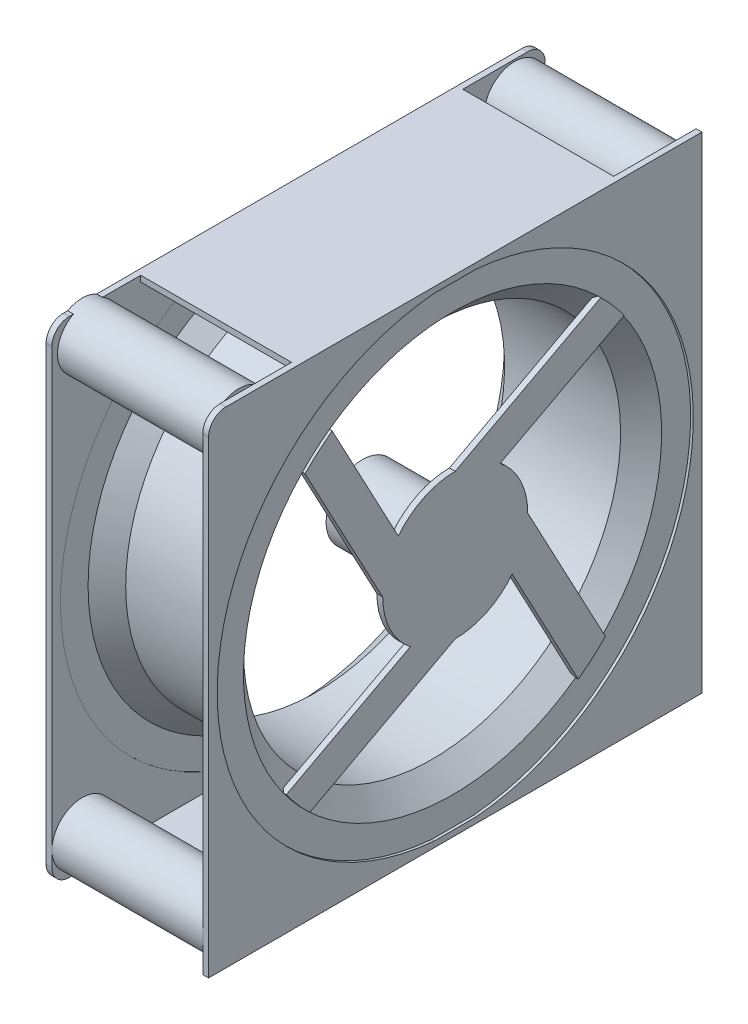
from build123d import *

# Parameters (mm, degrees)
SHELL1_T             = -1.27
SKETCH9_R            = 31.75
BOSS_EXTRUDE6_DEPTH  = 2.54
BOSS_EXTRUDE7_DEPTH  = 2.54
CIRPATTERN1_COUNT    = 4
BOSS_EXTRUDE9_START  = -2.54
SKETCH11_W           = 215.959794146
SKETCH11_H           = 212.715762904
SKETCH11_R           = 104.230256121
BOSS_EXTRUDE9_DEPTH  = 2.54
SKETCH12_R           = 15.875
BOSS_EXTRUDE10_DEPTH = 38.1
SKETCH13_W           = 215.959794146
SKETCH13_H           = 212.715762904
SKETCH13_R           = 104.230256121
BOSS_EXTRUDE11_DEPTH = 2.54
SKETCH16_R           = 13.338062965
BOSS_EXTRUDE12_DEPTH = 68.58
CIRPATTERN3_COUNT    = 4
BOSS_EXTRUDE13_START = -68.58
SKETCH18_W           = 141.038258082
SKETCH18_H           = 2.54
BOSS_EXTRUDE13_DEPTH = 68.58
CIRPATTERN4_COUNT    = 2
SKETCH20_R           = 7.46203813
CUT_EXTRUDE1_DEPTH   = 33.02
FILLET1_R            = 2.54
FILLET2_R            = 2.54
FILLET3_R            = 7.62


with BuildPart() as part:
    # Sketch1 → Revolve1 (revolve)
    with BuildSketch(Plane(origin=(0, 0, 0), x_dir=(1, 0, 0), z_dir=(0, 1, 0)), mode=Mode.PRIVATE) as revolve1_sk:
        Polygon((-25.4, 82.55), (25.4, 82.55), (34.380256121, 91.530256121), (34.380256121, 104.230256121), (-34.380256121, 104.230256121), (-34.380256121, 91.530256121), align=None)
    revolve(revolve1_sk.sketch.rotate(Axis((-63.909916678, 0, 0), (1, 0, 0)), 180), axis=Axis((-63.909916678, 0, 0), (1, 0, 0)))

    # Shell1
    shell1_openings = [part.faces().sort_by_distance(p)[0] for p in [
        (0, 0, -104.230256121),
    ]]
    offset(amount=SHELL1_T, openings=shell1_openings, kind=Kind.INTERSECTION)



with BuildPart() as body_2:
    # Sketch9 → Boss-Extrude6 (new body)
    with BuildSketch(Plane(origin=(35.56, 0, 0), x_dir=(0, 0, -1), z_dir=(1, 0, 0))):
        Circle(SKETCH9_R)
    extrude(amount=-BOSS_EXTRUDE6_DEPTH)


with BuildPart() as part_1:
    add(part.part)

    add(body_2.part)  # Boss-Extrude7 merges body 2
    # Sketch10 → Boss-Extrude7 (add)
    with BuildSketch(Plane(origin=(35.56, 0, 0), x_dir=(0, 0, -1), z_dir=(1, 0, 0))):
        with BuildLine():
            ThreePointArc((19.666290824, 24.92588023), (10.408309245, 29.995492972), (0, 31.75))
            Line((0, 31.75), (63.682621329, 65.744288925))
            ThreePointArc((63.682621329, 65.744288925), (69.093485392, 60.032308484), (73.993811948, 53.876744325))
            Line((73.993811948, 53.876744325), (19.666290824, 24.92588023))
        make_face()
    boss_extrude7 = extrude(amount=-BOSS_EXTRUDE7_DEPTH)

    # CirPattern1: Boss-Extrude7 ×4 about axis
    cirpattern1_axis = Axis((0, 0, 0), (1, 0, 0))
    for i in range(1, CIRPATTERN1_COUNT):
        add(boss_extrude7.rotate(cirpattern1_axis, i * 360 / CIRPATTERN1_COUNT))

    # Sketch11 → Boss-Extrude9 (add)
    with BuildSketch(Plane(origin=(35.56, 0, 0), x_dir=(0, 0, -1), z_dir=(1, 0, 0)).offset(BOSS_EXTRUDE9_START)):
        Rectangle(SKETCH11_W, SKETCH11_H)
        with Locations(Location((0, 0, 0), (0, 0, 180))):
            Circle(SKETCH11_R, mode=Mode.SUBTRACT)
    extrude(amount=BOSS_EXTRUDE9_DEPTH)

    # Sketch12 → Boss-Extrude10 (add)
    with BuildSketch(Plane.ZY.offset(-33.02)):
        with Locations(Location((0, 0, 0), (0, 0, 180))):
            Circle(SKETCH12_R)
    extrude(amount=BOSS_EXTRUDE10_DEPTH)

    # Sketch13 → Boss-Extrude11 (add)
    with BuildSketch(Plane(origin=(-35.56, 0, 0), x_dir=(0, 0, -1), z_dir=(1, 0, 0))):
        Rectangle(SKETCH13_W, SKETCH13_H)
        Circle(SKETCH13_R, mode=Mode.SUBTRACT)
    extrude(amount=BOSS_EXTRUDE11_DEPTH)

    # Sketch16 → Boss-Extrude12 (add)
    with BuildSketch(Plane.ZY.offset(35.56)):
        with Locations(Location((-94.641834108, 92.204036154, 0), (0, 0, 180))):
            Circle(SKETCH16_R)
    boss_extrude12 = extrude(amount=-BOSS_EXTRUDE12_DEPTH)

    # CirPattern3: Boss-Extrude12 ×4 about axis
    cirpattern3_axis = Axis((0, 0, 0), (1, 0, 0))
    for i in range(1, CIRPATTERN3_COUNT):
        add(boss_extrude12.rotate(cirpattern3_axis, i * 360 / CIRPATTERN3_COUNT))

    # Sketch18 → Boss-Extrude13 (add)
    with BuildSketch(Plane(origin=(35.56, 0, 0), x_dir=(0, 0, -1), z_dir=(1, 0, 0)).offset(BOSS_EXTRUDE13_START)):
        with Locations((1.387261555, 105.087881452)):
            Rectangle(SKETCH18_W, SKETCH18_H)
    boss_extrude13 = extrude(amount=BOSS_EXTRUDE13_DEPTH)

    # CirPattern4: Boss-Extrude13 ×2 about axis
    cirpattern4_axis = Axis((0, 0, 0), (1, 0, 0))
    for i in range(1, CIRPATTERN4_COUNT):
        add(boss_extrude13.rotate(cirpattern4_axis, i * 360 / CIRPATTERN4_COUNT))

    # Sketch20 → Cut-Extrude1 (cut)
    with BuildSketch(Plane.ZY.offset(35.56)):
        with Locations((-96.261765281, 92.823845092)):
            Circle(SKETCH20_R)
        with Locations((91.530256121, 92.823845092)):
            Circle(SKETCH20_R)
        with Locations((-96.261765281, -91.530256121)):
            Circle(SKETCH20_R)
        with Locations((91.530256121, -91.530256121)):
            Circle(SKETCH20_R)
    extrude(amount=-CUT_EXTRUDE1_DEPTH, mode=Mode.SUBTRACT)

    # Fillet1
    fillet1_edges = [part_1.edges().sort_by_distance(p)[0] for p in [
        (-35.56, 92.823845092, -103.723803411),
    ]]
    fillet(fillet1_edges, radius=FILLET1_R)

    # Fillet2
    fillet2_edges = [part_1.edges().sort_by_distance(p)[0] for p in [
        (-35.56, 92.823845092, 84.068217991),
        (-35.56, -91.530256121, -103.723803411),
        (-35.56, -91.530256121, 84.068217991),
    ]]
    fillet(fillet2_edges, radius=FILLET2_R)

    # Fillet3
    fillet3_edges = [part_1.edges().sort_by_distance(p)[0] for p in [
        (-34.29, 106.357881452, 107.979897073),
        (-34.29, -106.357881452, 107.979897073),
        (-34.29, -106.357881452, -107.979897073),
        (-34.29, 106.357881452, -107.979897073),
        (34.29, 106.357881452, 107.979897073),
    ]]
    fillet(fillet3_edges, radius=FILLET3_R)


solid = part_1.part
